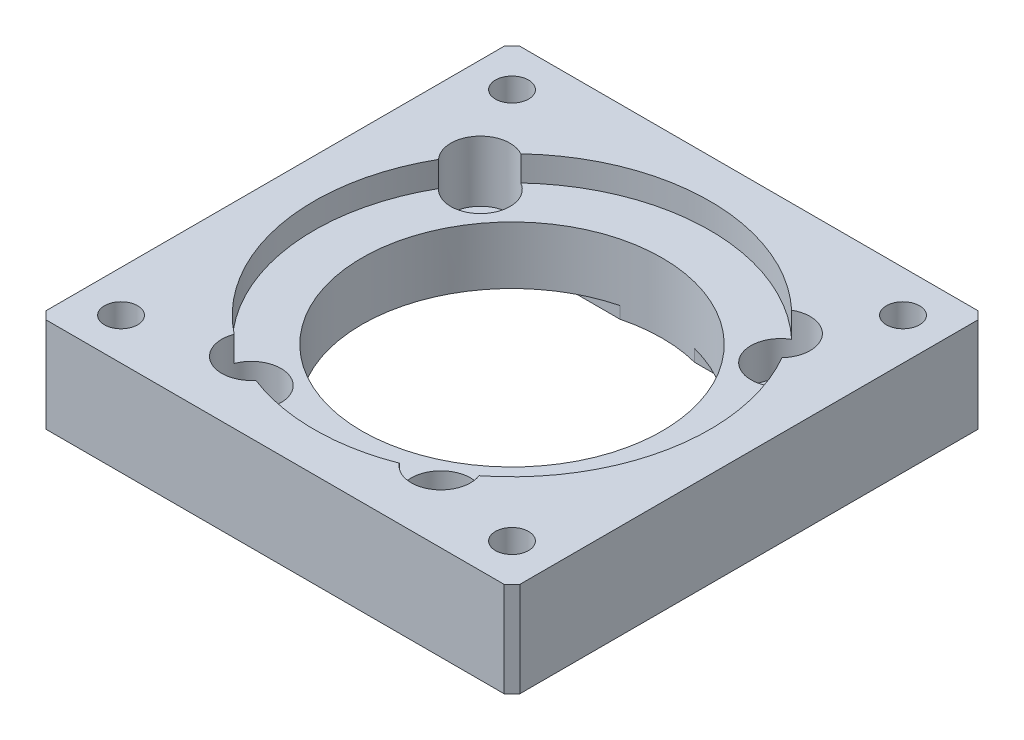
ISO-10303-21;
HEADER;
FILE_DESCRIPTION(('STEP AP214'),'2;1');
FILE_NAME('part.step','',(''),(''),'','','');
FILE_SCHEMA(('AUTOMOTIVE_DESIGN { 1 0 10303 214 1 1 1 1 }'));
ENDSEC;
DATA;
#1=APPLICATION_CONTEXT('core data for automotive mechanical design processes');
#2=APPLICATION_PROTOCOL_DEFINITION('international standard','automotive_design',2000,#1);
#3=PRODUCT_CONTEXT('',#1,'mechanical');
#4=PRODUCT('Part','Part','',(#3));
#5=PRODUCT_RELATED_PRODUCT_CATEGORY('part','',(#4));
#6=PRODUCT_DEFINITION_FORMATION('','',#4);
#7=PRODUCT_DEFINITION_CONTEXT('part definition',#1,'design');
#8=PRODUCT_DEFINITION('design','',#6,#7);
#9=PRODUCT_DEFINITION_SHAPE('','',#8);
#10=(LENGTH_UNIT() NAMED_UNIT(*) SI_UNIT(.MILLI.,.METRE.));
#11=(NAMED_UNIT(*) PLANE_ANGLE_UNIT() SI_UNIT($,.RADIAN.));
#12=(NAMED_UNIT(*) SI_UNIT($,.STERADIAN.) SOLID_ANGLE_UNIT());
#13=UNCERTAINTY_MEASURE_WITH_UNIT(LENGTH_MEASURE(1.E-05),#10,'distance_accuracy_value','');
#14=(GEOMETRIC_REPRESENTATION_CONTEXT(3) GLOBAL_UNCERTAINTY_ASSIGNED_CONTEXT((#13)) GLOBAL_UNIT_ASSIGNED_CONTEXT((#10,
#11,#12)) REPRESENTATION_CONTEXT('',''));
#15=CARTESIAN_POINT('',(0.,0.,0.));
#16=DIRECTION('',(0.,0.,1.));
#17=DIRECTION('',(1.,0.,0.));
#18=AXIS2_PLACEMENT_3D('',#15,#16,#17);
#19=CARTESIAN_POINT('',(0.,8.8,0.));
#20=DIRECTION('',(0.,1.,0.));
#21=DIRECTION('',(0.,0.,1.));
#22=AXIS2_PLACEMENT_3D('',#19,#20,#21);
#23=CYLINDRICAL_SURFACE('',#22,25.05);
#24=CARTESIAN_POINT('',(0.,8.8,0.));
#25=DIRECTION('',(0.,1.,0.));
#26=DIRECTION('',(0.,0.,1.));
#27=AXIS2_PLACEMENT_3D('',#24,#25,#26);
#28=CIRCLE('',#27,25.05);
#29=CARTESIAN_POINT('',(15.5073400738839,8.8,19.6729485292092));
#30=VERTEX_POINT('',#29);
#31=CARTESIAN_POINT('',(21.7418197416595,8.8,-12.441694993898));
#32=VERTEX_POINT('',#31);
#33=EDGE_CURVE('E223',#30,#32,#28,.T.);
#34=ORIENTED_EDGE('',*,*,#33,.F.);
#35=DIRECTION('',(0.,1.,0.));
#36=VECTOR('',#35,1.);
#37=CARTESIAN_POINT('',(15.5073400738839,8.15,19.6729485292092));
#38=LINE('',#37,#36);
#39=CARTESIAN_POINT('',(15.5073400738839,12.,19.6729485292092));
#40=VERTEX_POINT('',#39);
#41=EDGE_CURVE('E52',#30,#40,#38,.T.);
#42=ORIENTED_EDGE('',*,*,#41,.T.);
#43=CARTESIAN_POINT('',(0.,12.,0.));
#44=DIRECTION('',(0.,1.,0.));
#45=DIRECTION('',(0.,0.,1.));
#46=AXIS2_PLACEMENT_3D('',#43,#44,#45);
#47=CIRCLE('',#46,25.05);
#48=CARTESIAN_POINT('',(21.7418197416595,12.,-12.441694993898));
#49=VERTEX_POINT('',#48);
#50=EDGE_CURVE('E221',#40,#49,#47,.T.);
#51=ORIENTED_EDGE('',*,*,#50,.T.);
#52=DIRECTION('',(0.,1.,0.));
#53=VECTOR('',#52,1.);
#54=CARTESIAN_POINT('',(21.7418197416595,8.15,-12.441694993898));
#55=LINE('',#54,#53);
#56=EDGE_CURVE('E451',#49,#32,#55,.F.);
#57=ORIENTED_EDGE('',*,*,#56,.T.);
#58=EDGE_LOOP('',(#34,#42,#51,#57));
#59=FACE_BOUND('',#58,.T.);
#60=ADVANCED_FACE('F38',(#59),#23,.F.);
#61=CARTESIAN_POINT('',(-9.0760445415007,12.,23.3479745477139));
#62=VERTEX_POINT('',#61);
#63=CARTESIAN_POINT('',(9.07604454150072,12.,23.3479745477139));
#64=VERTEX_POINT('',#63);
#65=EDGE_CURVE('E230',#62,#64,#47,.T.);
#66=ORIENTED_EDGE('',*,*,#65,.T.);
#67=DIRECTION('',(0.,1.,0.));
#68=VECTOR('',#67,1.);
#69=CARTESIAN_POINT('',(9.07604454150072,8.15,23.3479745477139));
#70=LINE('',#69,#68);
#71=CARTESIAN_POINT('',(9.07604454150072,8.8,23.3479745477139));
#72=VERTEX_POINT('',#71);
#73=EDGE_CURVE('E211',#64,#72,#70,.F.);
#74=ORIENTED_EDGE('',*,*,#73,.T.);
#75=CARTESIAN_POINT('',(-9.07604454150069,8.8,23.3479745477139));
#76=VERTEX_POINT('',#75);
#77=EDGE_CURVE('E244',#76,#72,#28,.T.);
#78=ORIENTED_EDGE('',*,*,#77,.F.);
#79=DIRECTION('',(0.,1.,0.));
#80=VECTOR('',#79,1.);
#81=CARTESIAN_POINT('',(-9.0760445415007,8.15,23.3479745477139));
#82=LINE('',#81,#80);
#83=EDGE_CURVE('E60',#76,#62,#82,.T.);
#84=ORIENTED_EDGE('',*,*,#83,.T.);
#85=EDGE_LOOP('',(#66,#74,#78,#84));
#86=FACE_BOUND('',#85,.T.);
#87=ADVANCED_FACE('F329',(#86),#23,.F.);
#88=CARTESIAN_POINT('',(0.,12.,0.));
#89=DIRECTION('',(0.,-1.,0.));
#90=DIRECTION('',(0.,0.,-1.));
#91=AXIS2_PLACEMENT_3D('',#88,#89,#90);
#92=PLANE('',#91);
#93=DIRECTION('',(0.,0.,-1.));
#94=VECTOR('',#93,1.);
#95=CARTESIAN_POINT('',(30.,12.,30.));
#96=LINE('',#95,#94);
#97=CARTESIAN_POINT('',(30.,12.,29.));
#98=VERTEX_POINT('',#97);
#99=CARTESIAN_POINT('',(30.,12.,-29.));
#100=VERTEX_POINT('',#99);
#101=EDGE_CURVE('E576',#98,#100,#96,.T.);
#102=ORIENTED_EDGE('',*,*,#101,.T.);
#103=DIRECTION('',(0.707106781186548,0.,0.707106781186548));
#104=VECTOR('',#103,1.);
#105=CARTESIAN_POINT('',(29.,12.,-30.));
#106=LINE('',#105,#104);
#107=CARTESIAN_POINT('',(29.,12.,-30.));
#108=VERTEX_POINT('',#107);
#109=EDGE_CURVE('E437',#100,#108,#106,.F.);
#110=ORIENTED_EDGE('',*,*,#109,.T.);
#111=DIRECTION('',(-1.,0.,0.));
#112=VECTOR('',#111,1.);
#113=CARTESIAN_POINT('',(-30.,12.,-30.));
#114=LINE('',#113,#112);
#115=CARTESIAN_POINT('',(-29.,12.,-30.));
#116=VERTEX_POINT('',#115);
#117=EDGE_CURVE('E607',#108,#116,#114,.T.);
#118=ORIENTED_EDGE('',*,*,#117,.T.);
#119=DIRECTION('',(0.707106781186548,0.,-0.707106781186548));
#120=VECTOR('',#119,1.);
#121=CARTESIAN_POINT('',(-30.,12.,-29.));
#122=LINE('',#121,#120);
#123=CARTESIAN_POINT('',(-30.,12.,-29.));
#124=VERTEX_POINT('',#123);
#125=EDGE_CURVE('E434',#116,#124,#122,.F.);
#126=ORIENTED_EDGE('',*,*,#125,.T.);
#127=DIRECTION('',(0.,0.,1.));
#128=VECTOR('',#127,1.);
#129=CARTESIAN_POINT('',(-30.,12.,30.));
#130=LINE('',#129,#128);
#131=CARTESIAN_POINT('',(-30.,12.,29.));
#132=VERTEX_POINT('',#131);
#133=EDGE_CURVE('E611',#124,#132,#130,.T.);
#134=ORIENTED_EDGE('',*,*,#133,.T.);
#135=DIRECTION('',(-0.707106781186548,0.,-0.707106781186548));
#136=VECTOR('',#135,1.);
#137=CARTESIAN_POINT('',(-29.,12.,30.));
#138=LINE('',#137,#136);
#139=CARTESIAN_POINT('',(-29.,12.,30.));
#140=VERTEX_POINT('',#139);
#141=EDGE_CURVE('E427',#132,#140,#138,.F.);
#142=ORIENTED_EDGE('',*,*,#141,.T.);
#143=DIRECTION('',(1.,0.,0.));
#144=VECTOR('',#143,1.);
#145=CARTESIAN_POINT('',(-30.,12.,30.));
#146=LINE('',#145,#144);
#147=CARTESIAN_POINT('',(29.,12.,30.));
#148=VERTEX_POINT('',#147);
#149=EDGE_CURVE('E582',#140,#148,#146,.T.);
#150=ORIENTED_EDGE('',*,*,#149,.T.);
#151=DIRECTION('',(-0.707106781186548,0.,0.707106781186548));
#152=VECTOR('',#151,1.);
#153=CARTESIAN_POINT('',(30.,12.,29.));
#154=LINE('',#153,#152);
#155=EDGE_CURVE('E435',#148,#98,#154,.F.);
#156=ORIENTED_EDGE('',*,*,#155,.T.);
#157=EDGE_LOOP('',(#102,#110,#118,#126,#134,#142,#150,#156));
#158=FACE_BOUND('',#157,.T.);
#159=CARTESIAN_POINT('',(24.75,12.,24.75));
#160=DIRECTION('',(0.,1.,0.));
#161=DIRECTION('',(0.,0.,1.));
#162=AXIS2_PLACEMENT_3D('',#159,#160,#161);
#163=CIRCLE('',#162,2.1);
#164=CARTESIAN_POINT('',(24.75,12.,26.85));
#165=VERTEX_POINT('',#164);
#166=EDGE_CURVE('E236',#165,#165,#163,.T.);
#167=ORIENTED_EDGE('',*,*,#166,.F.);
#168=EDGE_LOOP('',(#167));
#169=FACE_BOUND('',#168,.T.);
#170=CARTESIAN_POINT('',(-24.75,12.,24.75));
#171=DIRECTION('',(0.,1.,0.));
#172=DIRECTION('',(0.,0.,1.));
#173=AXIS2_PLACEMENT_3D('',#170,#171,#172);
#174=CIRCLE('',#173,2.1);
#175=CARTESIAN_POINT('',(-24.75,12.,26.85));
#176=VERTEX_POINT('',#175);
#177=EDGE_CURVE('E309',#176,#176,#174,.T.);
#178=ORIENTED_EDGE('',*,*,#177,.F.);
#179=EDGE_LOOP('',(#178));
#180=FACE_BOUND('',#179,.T.);
#181=CARTESIAN_POINT('',(-24.75,12.,-24.75));
#182=DIRECTION('',(0.,1.,0.));
#183=DIRECTION('',(0.,0.,1.));
#184=AXIS2_PLACEMENT_3D('',#181,#182,#183);
#185=CIRCLE('',#184,2.1);
#186=CARTESIAN_POINT('',(-24.75,12.,-22.65));
#187=VERTEX_POINT('',#186);
#188=EDGE_CURVE('E305',#187,#187,#185,.T.);
#189=ORIENTED_EDGE('',*,*,#188,.F.);
#190=EDGE_LOOP('',(#189));
#191=FACE_BOUND('',#190,.T.);
#192=CARTESIAN_POINT('',(24.75,12.,-24.75));
#193=DIRECTION('',(0.,1.,0.));
#194=DIRECTION('',(0.,0.,1.));
#195=AXIS2_PLACEMENT_3D('',#192,#193,#194);
#196=CIRCLE('',#195,2.1);
#197=CARTESIAN_POINT('',(24.75,12.,-22.65));
#198=VERTEX_POINT('',#197);
#199=EDGE_CURVE('E301',#198,#198,#196,.T.);
#200=ORIENTED_EDGE('',*,*,#199,.F.);
#201=EDGE_LOOP('',(#200));
#202=FACE_BOUND('',#201,.T.);
#203=ORIENTED_EDGE('',*,*,#50,.F.);
#204=CARTESIAN_POINT('',(12.,12.,21.));
#205=DIRECTION('',(0.,1.,0.));
#206=DIRECTION('',(0.,0.,1.));
#207=AXIS2_PLACEMENT_3D('',#204,#205,#206);
#208=CIRCLE('',#207,3.75);
#209=EDGE_CURVE('E208',#64,#40,#208,.T.);
#210=ORIENTED_EDGE('',*,*,#209,.F.);
#211=ORIENTED_EDGE('',*,*,#65,.F.);
#212=CARTESIAN_POINT('',(-12.,12.,21.));
#213=DIRECTION('',(0.,1.,0.));
#214=DIRECTION('',(0.,0.,1.));
#215=AXIS2_PLACEMENT_3D('',#212,#213,#214);
#216=CIRCLE('',#215,3.75);
#217=CARTESIAN_POINT('',(-15.5073400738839,12.,19.6729485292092));
#218=VERTEX_POINT('',#217);
#219=EDGE_CURVE('E224',#218,#62,#216,.T.);
#220=ORIENTED_EDGE('',*,*,#219,.F.);
#221=CARTESIAN_POINT('',(-21.7418197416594,12.,-12.441694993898));
#222=VERTEX_POINT('',#221);
#223=EDGE_CURVE('E234',#222,#218,#47,.T.);
#224=ORIENTED_EDGE('',*,*,#223,.F.);
#225=CARTESIAN_POINT('',(-19.,12.,-15.));
#226=DIRECTION('',(0.,1.,0.));
#227=DIRECTION('',(0.,0.,1.));
#228=AXIS2_PLACEMENT_3D('',#225,#226,#227);
#229=CIRCLE('',#228,3.75);
#230=CARTESIAN_POINT('',(-17.147873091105,12.,-18.2606940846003));
#231=VERTEX_POINT('',#230);
#232=EDGE_CURVE('E258',#231,#222,#229,.T.);
#233=ORIENTED_EDGE('',*,*,#232,.F.);
#234=CARTESIAN_POINT('',(17.1478730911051,12.,-18.2606940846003));
#235=VERTEX_POINT('',#234);
#236=EDGE_CURVE('E233',#235,#231,#47,.T.);
#237=ORIENTED_EDGE('',*,*,#236,.F.);
#238=CARTESIAN_POINT('',(19.,12.,-15.));
#239=DIRECTION('',(0.,1.,0.));
#240=DIRECTION('',(0.,0.,1.));
#241=AXIS2_PLACEMENT_3D('',#238,#239,#240);
#242=CIRCLE('',#241,3.75);
#243=EDGE_CURVE('E229',#49,#235,#242,.T.);
#244=ORIENTED_EDGE('',*,*,#243,.F.);
#245=EDGE_LOOP('',(#203,#210,#211,#220,#224,#233,#237,#244));
#246=FACE_BOUND('',#245,.T.);
#247=ADVANCED_FACE('F227',(#158,#169,#180,#191,#202,#246),#92,.F.);
#248=ORIENTED_EDGE('',*,*,#223,.T.);
#249=DIRECTION('',(0.,1.,0.));
#250=VECTOR('',#249,1.);
#251=CARTESIAN_POINT('',(-15.5073400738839,8.15,19.6729485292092));
#252=LINE('',#251,#250);
#253=CARTESIAN_POINT('',(-15.5073400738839,8.8,19.6729485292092));
#254=VERTEX_POINT('',#253);
#255=EDGE_CURVE('E253',#218,#254,#252,.F.);
#256=ORIENTED_EDGE('',*,*,#255,.T.);
#257=CARTESIAN_POINT('',(-21.7418197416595,8.8,-12.441694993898));
#258=VERTEX_POINT('',#257);
#259=EDGE_CURVE('E316',#258,#254,#28,.T.);
#260=ORIENTED_EDGE('',*,*,#259,.F.);
#261=DIRECTION('',(0.,1.,0.));
#262=VECTOR('',#261,1.);
#263=CARTESIAN_POINT('',(-21.7418197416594,8.15,-12.441694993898));
#264=LINE('',#263,#262);
#265=EDGE_CURVE('E255',#258,#222,#264,.T.);
#266=ORIENTED_EDGE('',*,*,#265,.T.);
#267=EDGE_LOOP('',(#248,#256,#260,#266));
#268=FACE_BOUND('',#267,.T.);
#269=ADVANCED_FACE('F251',(#268),#23,.F.);
#270=CARTESIAN_POINT('',(0.,-8.,0.));
#271=DIRECTION('',(0.,1.,0.));
#272=DIRECTION('',(0.,0.,1.));
#273=AXIS2_PLACEMENT_3D('',#270,#271,#272);
#274=CYLINDRICAL_SURFACE('',#273,19.);
#275=CARTESIAN_POINT('',(0.,1.5,0.));
#276=DIRECTION('',(0.,-1.,0.));
#277=DIRECTION('',(0.,0.,-1.));
#278=AXIS2_PLACEMENT_3D('',#275,#276,#277);
#279=CIRCLE('',#278,19.);
#280=CARTESIAN_POINT('',(-4.73708771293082,1.5,-18.4));
#281=VERTEX_POINT('',#280);
#282=CARTESIAN_POINT('',(4.73708771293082,1.5,-18.4));
#283=VERTEX_POINT('',#282);
#284=EDGE_CURVE('E579',#281,#283,#279,.F.);
#285=ORIENTED_EDGE('',*,*,#284,.F.);
#286=DIRECTION('',(0.,1.,0.));
#287=VECTOR('',#286,1.);
#288=CARTESIAN_POINT('',(-4.73708771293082,-8.,-18.4));
#289=LINE('',#288,#287);
#290=CARTESIAN_POINT('',(-4.73708771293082,0.,-18.4));
#291=VERTEX_POINT('',#290);
#292=EDGE_CURVE('E585',#281,#291,#289,.F.);
#293=ORIENTED_EDGE('',*,*,#292,.T.);
#294=CARTESIAN_POINT('',(0.,0.,0.));
#295=DIRECTION('',(0.,-1.,0.));
#296=DIRECTION('',(0.,0.,-1.));
#297=AXIS2_PLACEMENT_3D('',#294,#295,#296);
#298=CIRCLE('',#297,19.);
#299=CARTESIAN_POINT('',(4.73708771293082,0.,-18.4));
#300=VERTEX_POINT('',#299);
#301=EDGE_CURVE('E570',#291,#300,#298,.T.);
#302=ORIENTED_EDGE('',*,*,#301,.T.);
#303=DIRECTION('',(0.,1.,0.));
#304=VECTOR('',#303,1.);
#305=CARTESIAN_POINT('',(4.73708771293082,-8.,-18.4));
#306=LINE('',#305,#304);
#307=EDGE_CURVE('E581',#300,#283,#306,.T.);
#308=ORIENTED_EDGE('',*,*,#307,.T.);
#309=EDGE_LOOP('',(#285,#293,#302,#308));
#310=FACE_BOUND('',#309,.T.);
#311=CARTESIAN_POINT('',(0.,8.8,0.));
#312=DIRECTION('',(0.,1.,0.));
#313=DIRECTION('',(0.,0.,1.));
#314=AXIS2_PLACEMENT_3D('',#311,#312,#313);
#315=CIRCLE('',#314,19.);
#316=CARTESIAN_POINT('',(0.,8.8,19.));
#317=VERTEX_POINT('',#316);
#318=EDGE_CURVE('E315',#317,#317,#315,.F.);
#319=ORIENTED_EDGE('',*,*,#318,.F.);
#320=EDGE_LOOP('',(#319));
#321=FACE_BOUND('',#320,.T.);
#322=ADVANCED_FACE('F378',(#310,#321),#274,.F.);
#323=CARTESIAN_POINT('',(30.,12.,30.));
#324=DIRECTION('',(-1.,0.,0.));
#325=DIRECTION('',(0.,0.,1.));
#326=AXIS2_PLACEMENT_3D('',#323,#324,#325);
#327=PLANE('',#326);
#328=DIRECTION('',(0.,0.,-1.));
#329=VECTOR('',#328,1.);
#330=CARTESIAN_POINT('',(30.,0.,30.));
#331=LINE('',#330,#329);
#332=CARTESIAN_POINT('',(30.,0.,29.));
#333=VERTEX_POINT('',#332);
#334=CARTESIAN_POINT('',(30.,0.,-29.));
#335=VERTEX_POINT('',#334);
#336=EDGE_CURVE('E565',#333,#335,#331,.T.);
#337=ORIENTED_EDGE('',*,*,#336,.T.);
#338=DIRECTION('',(0.,1.,0.));
#339=VECTOR('',#338,1.);
#340=CARTESIAN_POINT('',(30.,12.,-29.));
#341=LINE('',#340,#339);
#342=EDGE_CURVE('E439',#335,#100,#341,.T.);
#343=ORIENTED_EDGE('',*,*,#342,.T.);
#344=ORIENTED_EDGE('',*,*,#101,.F.);
#345=DIRECTION('',(0.,-1.,0.));
#346=VECTOR('',#345,1.);
#347=CARTESIAN_POINT('',(30.,12.,29.));
#348=LINE('',#347,#346);
#349=EDGE_CURVE('E598',#98,#333,#348,.T.);
#350=ORIENTED_EDGE('',*,*,#349,.T.);
#351=EDGE_LOOP('',(#337,#343,#344,#350));
#352=FACE_BOUND('',#351,.T.);
#353=ADVANCED_FACE('F383',(#352),#327,.F.);
#354=CARTESIAN_POINT('',(-30.,12.,-30.));
#355=DIRECTION('',(0.,0.,1.));
#356=DIRECTION('',(1.,0.,0.));
#357=AXIS2_PLACEMENT_3D('',#354,#355,#356);
#358=PLANE('',#357);
#359=ORIENTED_EDGE('',*,*,#117,.F.);
#360=DIRECTION('',(0.,-1.,0.));
#361=VECTOR('',#360,1.);
#362=CARTESIAN_POINT('',(29.,12.,-30.));
#363=LINE('',#362,#361);
#364=CARTESIAN_POINT('',(29.,0.,-30.));
#365=VERTEX_POINT('',#364);
#366=EDGE_CURVE('E590',#108,#365,#363,.T.);
#367=ORIENTED_EDGE('',*,*,#366,.T.);
#368=DIRECTION('',(-1.,0.,0.));
#369=VECTOR('',#368,1.);
#370=CARTESIAN_POINT('',(-30.,0.,-30.));
#371=LINE('',#370,#369);
#372=CARTESIAN_POINT('',(-29.,0.,-30.));
#373=VERTEX_POINT('',#372);
#374=EDGE_CURVE('E556',#365,#373,#371,.T.);
#375=ORIENTED_EDGE('',*,*,#374,.T.);
#376=DIRECTION('',(0.,1.,0.));
#377=VECTOR('',#376,1.);
#378=CARTESIAN_POINT('',(-29.,12.,-30.));
#379=LINE('',#378,#377);
#380=EDGE_CURVE('E587',#373,#116,#379,.T.);
#381=ORIENTED_EDGE('',*,*,#380,.T.);
#382=EDGE_LOOP('',(#359,#367,#375,#381));
#383=FACE_BOUND('',#382,.T.);
#384=ADVANCED_FACE('F406',(#383),#358,.F.);
#385=CARTESIAN_POINT('',(-30.,12.,30.));
#386=DIRECTION('',(1.,0.,0.));
#387=DIRECTION('',(0.,0.,-1.));
#388=AXIS2_PLACEMENT_3D('',#385,#386,#387);
#389=PLANE('',#388);
#390=ORIENTED_EDGE('',*,*,#133,.F.);
#391=DIRECTION('',(0.,-1.,0.));
#392=VECTOR('',#391,1.);
#393=CARTESIAN_POINT('',(-30.,12.,-29.));
#394=LINE('',#393,#392);
#395=CARTESIAN_POINT('',(-30.,0.,-29.));
#396=VERTEX_POINT('',#395);
#397=EDGE_CURVE('E445',#124,#396,#394,.T.);
#398=ORIENTED_EDGE('',*,*,#397,.T.);
#399=DIRECTION('',(0.,0.,1.));
#400=VECTOR('',#399,1.);
#401=CARTESIAN_POINT('',(-30.,0.,30.));
#402=LINE('',#401,#400);
#403=CARTESIAN_POINT('',(-30.,0.,29.));
#404=VERTEX_POINT('',#403);
#405=EDGE_CURVE('E564',#396,#404,#402,.T.);
#406=ORIENTED_EDGE('',*,*,#405,.T.);
#407=DIRECTION('',(0.,1.,0.));
#408=VECTOR('',#407,1.);
#409=CARTESIAN_POINT('',(-30.,12.,29.));
#410=LINE('',#409,#408);
#411=EDGE_CURVE('E428',#404,#132,#410,.T.);
#412=ORIENTED_EDGE('',*,*,#411,.T.);
#413=EDGE_LOOP('',(#390,#398,#406,#412));
#414=FACE_BOUND('',#413,.T.);
#415=ADVANCED_FACE('F402',(#414),#389,.F.);
#416=CARTESIAN_POINT('',(-30.,12.,30.));
#417=DIRECTION('',(0.,0.,-1.));
#418=DIRECTION('',(-1.,0.,0.));
#419=AXIS2_PLACEMENT_3D('',#416,#417,#418);
#420=PLANE('',#419);
#421=ORIENTED_EDGE('',*,*,#149,.F.);
#422=DIRECTION('',(0.,-1.,0.));
#423=VECTOR('',#422,1.);
#424=CARTESIAN_POINT('',(-29.,12.,30.));
#425=LINE('',#424,#423);
#426=CARTESIAN_POINT('',(-29.,0.,30.));
#427=VERTEX_POINT('',#426);
#428=EDGE_CURVE('E430',#140,#427,#425,.T.);
#429=ORIENTED_EDGE('',*,*,#428,.T.);
#430=DIRECTION('',(1.,0.,0.));
#431=VECTOR('',#430,1.);
#432=CARTESIAN_POINT('',(-30.,0.,30.));
#433=LINE('',#432,#431);
#434=CARTESIAN_POINT('',(29.,0.,30.));
#435=VERTEX_POINT('',#434);
#436=EDGE_CURVE('E568',#427,#435,#433,.T.);
#437=ORIENTED_EDGE('',*,*,#436,.T.);
#438=DIRECTION('',(0.,1.,0.));
#439=VECTOR('',#438,1.);
#440=CARTESIAN_POINT('',(29.,12.,30.));
#441=LINE('',#440,#439);
#442=EDGE_CURVE('E448',#435,#148,#441,.T.);
#443=ORIENTED_EDGE('',*,*,#442,.T.);
#444=EDGE_LOOP('',(#421,#429,#437,#443));
#445=FACE_BOUND('',#444,.T.);
#446=ADVANCED_FACE('F398',(#445),#420,.F.);
#447=CARTESIAN_POINT('',(0.,0.,0.));
#448=DIRECTION('',(0.,-1.,0.));
#449=DIRECTION('',(0.,0.,-1.));
#450=AXIS2_PLACEMENT_3D('',#447,#448,#449);
#451=PLANE('',#450);
#452=CARTESIAN_POINT('',(24.75,0.,-24.75));
#453=DIRECTION('',(0.,-1.,0.));
#454=DIRECTION('',(0.,0.,-1.));
#455=AXIS2_PLACEMENT_3D('',#452,#453,#454);
#456=CIRCLE('',#455,2.1);
#457=CARTESIAN_POINT('',(24.75,0.,-26.85));
#458=VERTEX_POINT('',#457);
#459=EDGE_CURVE('E304',#458,#458,#456,.T.);
#460=ORIENTED_EDGE('',*,*,#459,.F.);
#461=EDGE_LOOP('',(#460));
#462=FACE_BOUND('',#461,.T.);
#463=CARTESIAN_POINT('',(-24.75,0.,-24.75));
#464=DIRECTION('',(0.,-1.,0.));
#465=DIRECTION('',(0.,0.,-1.));
#466=AXIS2_PLACEMENT_3D('',#463,#464,#465);
#467=CIRCLE('',#466,2.1);
#468=CARTESIAN_POINT('',(-24.75,0.,-26.85));
#469=VERTEX_POINT('',#468);
#470=EDGE_CURVE('E308',#469,#469,#467,.T.);
#471=ORIENTED_EDGE('',*,*,#470,.F.);
#472=EDGE_LOOP('',(#471));
#473=FACE_BOUND('',#472,.T.);
#474=CARTESIAN_POINT('',(-24.75,0.,24.75));
#475=DIRECTION('',(0.,-1.,0.));
#476=DIRECTION('',(0.,0.,-1.));
#477=AXIS2_PLACEMENT_3D('',#474,#475,#476);
#478=CIRCLE('',#477,2.1);
#479=CARTESIAN_POINT('',(-24.75,0.,22.65));
#480=VERTEX_POINT('',#479);
#481=EDGE_CURVE('E312',#480,#480,#478,.T.);
#482=ORIENTED_EDGE('',*,*,#481,.F.);
#483=EDGE_LOOP('',(#482));
#484=FACE_BOUND('',#483,.T.);
#485=CARTESIAN_POINT('',(24.75,0.,24.75));
#486=DIRECTION('',(0.,-1.,0.));
#487=DIRECTION('',(0.,0.,-1.));
#488=AXIS2_PLACEMENT_3D('',#485,#486,#487);
#489=CIRCLE('',#488,2.1);
#490=CARTESIAN_POINT('',(24.75,0.,22.65));
#491=VERTEX_POINT('',#490);
#492=EDGE_CURVE('E231',#491,#491,#489,.T.);
#493=ORIENTED_EDGE('',*,*,#492,.F.);
#494=EDGE_LOOP('',(#493));
#495=FACE_BOUND('',#494,.T.);
#496=DIRECTION('',(1.,0.,0.));
#497=VECTOR('',#496,1.);
#498=CARTESIAN_POINT('',(-16.,0.,-18.4));
#499=LINE('',#498,#497);
#500=CARTESIAN_POINT('',(16.,0.,-18.4));
#501=VERTEX_POINT('',#500);
#502=EDGE_CURVE('E552',#300,#501,#499,.T.);
#503=ORIENTED_EDGE('',*,*,#502,.F.);
#504=ORIENTED_EDGE('',*,*,#301,.F.);
#505=CARTESIAN_POINT('',(-16.,0.,-18.4));
#506=VERTEX_POINT('',#505);
#507=EDGE_CURVE('E636',#506,#291,#499,.T.);
#508=ORIENTED_EDGE('',*,*,#507,.F.);
#509=CARTESIAN_POINT('',(-20.,0.,-18.4));
#510=DIRECTION('',(0.,-1.,0.));
#511=DIRECTION('',(0.,0.,-1.));
#512=AXIS2_PLACEMENT_3D('',#509,#510,#511);
#513=CIRCLE('',#512,4.);
#514=CARTESIAN_POINT('',(-24.,0.,-18.4));
#515=VERTEX_POINT('',#514);
#516=EDGE_CURVE('E639',#515,#506,#513,.T.);
#517=ORIENTED_EDGE('',*,*,#516,.F.);
#518=DIRECTION('',(0.,0.,-1.));
#519=VECTOR('',#518,1.);
#520=CARTESIAN_POINT('',(-24.,0.,19.));
#521=LINE('',#520,#519);
#522=CARTESIAN_POINT('',(-24.,0.,19.));
#523=VERTEX_POINT('',#522);
#524=EDGE_CURVE('E642',#523,#515,#521,.T.);
#525=ORIENTED_EDGE('',*,*,#524,.F.);
#526=CARTESIAN_POINT('',(-19.,0.,19.));
#527=DIRECTION('',(0.,-1.,0.));
#528=DIRECTION('',(0.,0.,1.));
#529=AXIS2_PLACEMENT_3D('',#526,#527,#528);
#530=CIRCLE('',#529,5.);
#531=CARTESIAN_POINT('',(-19.,0.,24.));
#532=VERTEX_POINT('',#531);
#533=EDGE_CURVE('E645',#532,#523,#530,.T.);
#534=ORIENTED_EDGE('',*,*,#533,.F.);
#535=DIRECTION('',(-1.,0.,0.));
#536=VECTOR('',#535,1.);
#537=CARTESIAN_POINT('',(-19.,0.,24.));
#538=LINE('',#537,#536);
#539=CARTESIAN_POINT('',(19.,0.,24.));
#540=VERTEX_POINT('',#539);
#541=EDGE_CURVE('E648',#540,#532,#538,.T.);
#542=ORIENTED_EDGE('',*,*,#541,.F.);
#543=CARTESIAN_POINT('',(19.,0.,19.));
#544=DIRECTION('',(0.,-1.,0.));
#545=DIRECTION('',(0.,0.,-1.));
#546=AXIS2_PLACEMENT_3D('',#543,#544,#545);
#547=CIRCLE('',#546,5.);
#548=CARTESIAN_POINT('',(24.,0.,19.));
#549=VERTEX_POINT('',#548);
#550=EDGE_CURVE('E651',#549,#540,#547,.T.);
#551=ORIENTED_EDGE('',*,*,#550,.F.);
#552=DIRECTION('',(0.,0.,1.));
#553=VECTOR('',#552,1.);
#554=CARTESIAN_POINT('',(24.,0.,19.));
#555=LINE('',#554,#553);
#556=CARTESIAN_POINT('',(24.,0.,-18.4));
#557=VERTEX_POINT('',#556);
#558=EDGE_CURVE('E654',#557,#549,#555,.T.);
#559=ORIENTED_EDGE('',*,*,#558,.F.);
#560=CARTESIAN_POINT('',(20.,0.,-18.4));
#561=DIRECTION('',(0.,-1.,0.));
#562=DIRECTION('',(0.,0.,-1.));
#563=AXIS2_PLACEMENT_3D('',#560,#561,#562);
#564=CIRCLE('',#563,4.);
#565=EDGE_CURVE('E322',#501,#557,#564,.T.);
#566=ORIENTED_EDGE('',*,*,#565,.F.);
#567=EDGE_LOOP('',(#503,#504,#508,#517,#525,#534,#542,#551,#559,#566));
#568=FACE_BOUND('',#567,.T.);
#569=ORIENTED_EDGE('',*,*,#374,.F.);
#570=DIRECTION('',(-0.707106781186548,0.,-0.707106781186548));
#571=VECTOR('',#570,1.);
#572=CARTESIAN_POINT('',(29.5,0.,-29.5));
#573=LINE('',#572,#571);
#574=EDGE_CURVE('E558',#365,#335,#573,.F.);
#575=ORIENTED_EDGE('',*,*,#574,.T.);
#576=ORIENTED_EDGE('',*,*,#336,.F.);
#577=DIRECTION('',(0.707106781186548,0.,-0.707106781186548));
#578=VECTOR('',#577,1.);
#579=CARTESIAN_POINT('',(29.5,0.,29.5));
#580=LINE('',#579,#578);
#581=EDGE_CURVE('E592',#333,#435,#580,.F.);
#582=ORIENTED_EDGE('',*,*,#581,.T.);
#583=ORIENTED_EDGE('',*,*,#436,.F.);
#584=DIRECTION('',(0.707106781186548,0.,0.707106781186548));
#585=VECTOR('',#584,1.);
#586=CARTESIAN_POINT('',(-29.5,0.,29.5));
#587=LINE('',#586,#585);
#588=EDGE_CURVE('E594',#427,#404,#587,.F.);
#589=ORIENTED_EDGE('',*,*,#588,.T.);
#590=ORIENTED_EDGE('',*,*,#405,.F.);
#591=DIRECTION('',(-0.707106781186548,0.,0.707106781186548));
#592=VECTOR('',#591,1.);
#593=CARTESIAN_POINT('',(-29.5,0.,-29.5));
#594=LINE('',#593,#592);
#595=EDGE_CURVE('E561',#396,#373,#594,.F.);
#596=ORIENTED_EDGE('',*,*,#595,.T.);
#597=EDGE_LOOP('',(#569,#575,#576,#582,#583,#589,#590,#596));
#598=FACE_BOUND('',#597,.T.);
#599=ADVANCED_FACE('F394',(#462,#473,#484,#495,#568,#598),#451,.T.);
#600=CARTESIAN_POINT('',(-16.,1.5,-18.4));
#601=DIRECTION('',(0.,0.,-1.));
#602=DIRECTION('',(-1.,0.,0.));
#603=AXIS2_PLACEMENT_3D('',#600,#601,#602);
#604=PLANE('',#603);
#605=DIRECTION('',(1.,0.,0.));
#606=VECTOR('',#605,1.);
#607=CARTESIAN_POINT('',(-16.,1.5,-18.4));
#608=LINE('',#607,#606);
#609=CARTESIAN_POINT('',(-16.,1.5,-18.4));
#610=VERTEX_POINT('',#609);
#611=EDGE_CURVE('E622',#610,#281,#608,.T.);
#612=ORIENTED_EDGE('',*,*,#611,.F.);
#613=DIRECTION('',(0.,-1.,0.));
#614=VECTOR('',#613,1.);
#615=CARTESIAN_POINT('',(-16.,1.5,-18.4));
#616=LINE('',#615,#614);
#617=EDGE_CURVE('E632',#610,#506,#616,.T.);
#618=ORIENTED_EDGE('',*,*,#617,.T.);
#619=ORIENTED_EDGE('',*,*,#507,.T.);
#620=ORIENTED_EDGE('',*,*,#292,.F.);
#621=EDGE_LOOP('',(#612,#618,#619,#620));
#622=FACE_BOUND('',#621,.T.);
#623=ADVANCED_FACE('F397',(#622),#604,.F.);
#624=ORIENTED_EDGE('',*,*,#502,.T.);
#625=DIRECTION('',(0.,-1.,0.));
#626=VECTOR('',#625,1.);
#627=CARTESIAN_POINT('',(16.,1.5,-18.4));
#628=LINE('',#627,#626);
#629=CARTESIAN_POINT('',(16.,1.5,-18.4));
#630=VERTEX_POINT('',#629);
#631=EDGE_CURVE('E578',#630,#501,#628,.T.);
#632=ORIENTED_EDGE('',*,*,#631,.F.);
#633=EDGE_CURVE('E660',#283,#630,#608,.T.);
#634=ORIENTED_EDGE('',*,*,#633,.F.);
#635=ORIENTED_EDGE('',*,*,#307,.F.);
#636=EDGE_LOOP('',(#624,#632,#634,#635));
#637=FACE_BOUND('',#636,.T.);
#638=ADVANCED_FACE('F714',(#637),#604,.F.);
#639=CARTESIAN_POINT('',(20.,1.5,-18.4));
#640=DIRECTION('',(0.,-1.,0.));
#641=DIRECTION('',(0.,0.,-1.));
#642=AXIS2_PLACEMENT_3D('',#639,#640,#641);
#643=PLANE('',#642);
#644=CARTESIAN_POINT('',(12.,1.5,21.));
#645=DIRECTION('',(0.,-1.,0.));
#646=DIRECTION('',(0.,0.,-1.));
#647=AXIS2_PLACEMENT_3D('',#644,#645,#646);
#648=CIRCLE('',#647,1.41786025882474);
#649=CARTESIAN_POINT('',(12.,1.5,19.5821397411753));
#650=VERTEX_POINT('',#649);
#651=EDGE_CURVE('E330',#650,#650,#648,.T.);
#652=ORIENTED_EDGE('',*,*,#651,.F.);
#653=EDGE_LOOP('',(#652));
#654=FACE_BOUND('',#653,.T.);
#655=CARTESIAN_POINT('',(-12.,1.5,21.));
#656=DIRECTION('',(0.,-1.,0.));
#657=DIRECTION('',(0.,0.,-1.));
#658=AXIS2_PLACEMENT_3D('',#655,#656,#657);
#659=CIRCLE('',#658,1.41786025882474);
#660=CARTESIAN_POINT('',(-12.,1.5,19.5821397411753));
#661=VERTEX_POINT('',#660);
#662=EDGE_CURVE('E271',#661,#661,#659,.T.);
#663=ORIENTED_EDGE('',*,*,#662,.F.);
#664=EDGE_LOOP('',(#663));
#665=FACE_BOUND('',#664,.T.);
#666=CARTESIAN_POINT('',(-19.,1.5,-15.));
#667=DIRECTION('',(0.,-1.,0.));
#668=DIRECTION('',(0.,0.,-1.));
#669=AXIS2_PLACEMENT_3D('',#666,#667,#668);
#670=CIRCLE('',#669,1.41786025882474);
#671=CARTESIAN_POINT('',(-19.,1.5,-16.4178602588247));
#672=VERTEX_POINT('',#671);
#673=EDGE_CURVE('E286',#672,#672,#670,.T.);
#674=ORIENTED_EDGE('',*,*,#673,.F.);
#675=EDGE_LOOP('',(#674));
#676=FACE_BOUND('',#675,.T.);
#677=CARTESIAN_POINT('',(19.,1.5,-15.));
#678=DIRECTION('',(0.,-1.,0.));
#679=DIRECTION('',(0.,0.,-1.));
#680=AXIS2_PLACEMENT_3D('',#677,#678,#679);
#681=CIRCLE('',#680,1.41786025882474);
#682=CARTESIAN_POINT('',(19.,1.5,-16.4178602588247));
#683=VERTEX_POINT('',#682);
#684=EDGE_CURVE('E297',#683,#683,#681,.T.);
#685=ORIENTED_EDGE('',*,*,#684,.F.);
#686=EDGE_LOOP('',(#685));
#687=FACE_BOUND('',#686,.T.);
#688=ORIENTED_EDGE('',*,*,#284,.T.);
#689=ORIENTED_EDGE('',*,*,#633,.T.);
#690=CARTESIAN_POINT('',(20.,1.5,-18.4));
#691=DIRECTION('',(0.,-1.,0.));
#692=DIRECTION('',(0.,0.,-1.));
#693=AXIS2_PLACEMENT_3D('',#690,#691,#692);
#694=CIRCLE('',#693,4.);
#695=CARTESIAN_POINT('',(24.,1.5,-18.4));
#696=VERTEX_POINT('',#695);
#697=EDGE_CURVE('E638',#630,#696,#694,.T.);
#698=ORIENTED_EDGE('',*,*,#697,.T.);
#699=DIRECTION('',(0.,0.,1.));
#700=VECTOR('',#699,1.);
#701=CARTESIAN_POINT('',(24.,1.5,19.));
#702=LINE('',#701,#700);
#703=CARTESIAN_POINT('',(24.,1.5,19.));
#704=VERTEX_POINT('',#703);
#705=EDGE_CURVE('E676',#696,#704,#702,.T.);
#706=ORIENTED_EDGE('',*,*,#705,.T.);
#707=CARTESIAN_POINT('',(19.,1.5,19.));
#708=DIRECTION('',(0.,-1.,0.));
#709=DIRECTION('',(0.,0.,-1.));
#710=AXIS2_PLACEMENT_3D('',#707,#708,#709);
#711=CIRCLE('',#710,5.);
#712=CARTESIAN_POINT('',(19.,1.5,24.));
#713=VERTEX_POINT('',#712);
#714=EDGE_CURVE('E673',#704,#713,#711,.T.);
#715=ORIENTED_EDGE('',*,*,#714,.T.);
#716=DIRECTION('',(-1.,0.,0.));
#717=VECTOR('',#716,1.);
#718=CARTESIAN_POINT('',(-19.,1.5,24.));
#719=LINE('',#718,#717);
#720=CARTESIAN_POINT('',(-19.,1.5,24.));
#721=VERTEX_POINT('',#720);
#722=EDGE_CURVE('E670',#713,#721,#719,.T.);
#723=ORIENTED_EDGE('',*,*,#722,.T.);
#724=CARTESIAN_POINT('',(-19.,1.5,19.));
#725=DIRECTION('',(0.,-1.,0.));
#726=DIRECTION('',(0.,0.,1.));
#727=AXIS2_PLACEMENT_3D('',#724,#725,#726);
#728=CIRCLE('',#727,5.);
#729=CARTESIAN_POINT('',(-24.,1.5,19.));
#730=VERTEX_POINT('',#729);
#731=EDGE_CURVE('E667',#721,#730,#728,.T.);
#732=ORIENTED_EDGE('',*,*,#731,.T.);
#733=DIRECTION('',(0.,0.,-1.));
#734=VECTOR('',#733,1.);
#735=CARTESIAN_POINT('',(-24.,1.5,19.));
#736=LINE('',#735,#734);
#737=CARTESIAN_POINT('',(-24.,1.5,-18.4));
#738=VERTEX_POINT('',#737);
#739=EDGE_CURVE('E664',#730,#738,#736,.T.);
#740=ORIENTED_EDGE('',*,*,#739,.T.);
#741=CARTESIAN_POINT('',(-20.,1.5,-18.4));
#742=DIRECTION('',(0.,-1.,0.));
#743=DIRECTION('',(0.,0.,-1.));
#744=AXIS2_PLACEMENT_3D('',#741,#742,#743);
#745=CIRCLE('',#744,4.);
#746=EDGE_CURVE('E661',#738,#610,#745,.T.);
#747=ORIENTED_EDGE('',*,*,#746,.T.);
#748=ORIENTED_EDGE('',*,*,#611,.T.);
#749=EDGE_LOOP('',(#688,#689,#698,#706,#715,#723,#732,#740,#747,#748));
#750=FACE_BOUND('',#749,.T.);
#751=ADVANCED_FACE('F681',(#654,#665,#676,#687,#750),#643,.T.);
#752=CARTESIAN_POINT('',(20.,1.5,-18.4));
#753=DIRECTION('',(0.,-1.,0.));
#754=DIRECTION('',(0.,0.,-1.));
#755=AXIS2_PLACEMENT_3D('',#752,#753,#754);
#756=CYLINDRICAL_SURFACE('',#755,4.);
#757=ORIENTED_EDGE('',*,*,#565,.T.);
#758=DIRECTION('',(0.,-1.,0.));
#759=VECTOR('',#758,1.);
#760=CARTESIAN_POINT('',(24.,1.5,-18.4));
#761=LINE('',#760,#759);
#762=EDGE_CURVE('E619',#696,#557,#761,.T.);
#763=ORIENTED_EDGE('',*,*,#762,.F.);
#764=ORIENTED_EDGE('',*,*,#697,.F.);
#765=ORIENTED_EDGE('',*,*,#631,.T.);
#766=EDGE_LOOP('',(#757,#763,#764,#765));
#767=FACE_BOUND('',#766,.T.);
#768=ADVANCED_FACE('F686',(#767),#756,.F.);
#769=CARTESIAN_POINT('',(-20.,1.5,-18.4));
#770=DIRECTION('',(0.,-1.,0.));
#771=DIRECTION('',(0.,0.,-1.));
#772=AXIS2_PLACEMENT_3D('',#769,#770,#771);
#773=CYLINDRICAL_SURFACE('',#772,4.);
#774=ORIENTED_EDGE('',*,*,#516,.T.);
#775=ORIENTED_EDGE('',*,*,#617,.F.);
#776=ORIENTED_EDGE('',*,*,#746,.F.);
#777=DIRECTION('',(0.,-1.,0.));
#778=VECTOR('',#777,1.);
#779=CARTESIAN_POINT('',(-24.,1.5,-18.4));
#780=LINE('',#779,#778);
#781=EDGE_CURVE('E630',#738,#515,#780,.T.);
#782=ORIENTED_EDGE('',*,*,#781,.T.);
#783=EDGE_LOOP('',(#774,#775,#776,#782));
#784=FACE_BOUND('',#783,.T.);
#785=ADVANCED_FACE('F723',(#784),#773,.F.);
#786=CARTESIAN_POINT('',(-24.,1.5,19.));
#787=DIRECTION('',(-1.,0.,0.));
#788=DIRECTION('',(0.,0.,1.));
#789=AXIS2_PLACEMENT_3D('',#786,#787,#788);
#790=PLANE('',#789);
#791=ORIENTED_EDGE('',*,*,#524,.T.);
#792=ORIENTED_EDGE('',*,*,#781,.F.);
#793=ORIENTED_EDGE('',*,*,#739,.F.);
#794=DIRECTION('',(0.,-1.,0.));
#795=VECTOR('',#794,1.);
#796=CARTESIAN_POINT('',(-24.,1.5,19.));
#797=LINE('',#796,#795);
#798=EDGE_CURVE('E628',#730,#523,#797,.T.);
#799=ORIENTED_EDGE('',*,*,#798,.T.);
#800=EDGE_LOOP('',(#791,#792,#793,#799));
#801=FACE_BOUND('',#800,.T.);
#802=ADVANCED_FACE('F704',(#801),#790,.F.);
#803=CARTESIAN_POINT('',(-19.,1.5,19.));
#804=DIRECTION('',(0.,-1.,0.));
#805=DIRECTION('',(0.,0.,-1.));
#806=AXIS2_PLACEMENT_3D('',#803,#804,#805);
#807=CYLINDRICAL_SURFACE('',#806,5.);
#808=ORIENTED_EDGE('',*,*,#533,.T.);
#809=ORIENTED_EDGE('',*,*,#798,.F.);
#810=ORIENTED_EDGE('',*,*,#731,.F.);
#811=DIRECTION('',(0.,-1.,0.));
#812=VECTOR('',#811,1.);
#813=CARTESIAN_POINT('',(-19.,1.5,24.));
#814=LINE('',#813,#812);
#815=EDGE_CURVE('E626',#721,#532,#814,.T.);
#816=ORIENTED_EDGE('',*,*,#815,.T.);
#817=EDGE_LOOP('',(#808,#809,#810,#816));
#818=FACE_BOUND('',#817,.T.);
#819=ADVANCED_FACE('F700',(#818),#807,.F.);
#820=CARTESIAN_POINT('',(-19.,1.5,24.));
#821=DIRECTION('',(0.,0.,1.));
#822=DIRECTION('',(1.,0.,0.));
#823=AXIS2_PLACEMENT_3D('',#820,#821,#822);
#824=PLANE('',#823);
#825=ORIENTED_EDGE('',*,*,#541,.T.);
#826=ORIENTED_EDGE('',*,*,#815,.F.);
#827=ORIENTED_EDGE('',*,*,#722,.F.);
#828=DIRECTION('',(0.,-1.,0.));
#829=VECTOR('',#828,1.);
#830=CARTESIAN_POINT('',(19.,1.5,24.));
#831=LINE('',#830,#829);
#832=EDGE_CURVE('E624',#713,#540,#831,.T.);
#833=ORIENTED_EDGE('',*,*,#832,.T.);
#834=EDGE_LOOP('',(#825,#826,#827,#833));
#835=FACE_BOUND('',#834,.T.);
#836=ADVANCED_FACE('F696',(#835),#824,.F.);
#837=CARTESIAN_POINT('',(19.,1.5,19.));
#838=DIRECTION('',(0.,-1.,0.));
#839=DIRECTION('',(0.,0.,-1.));
#840=AXIS2_PLACEMENT_3D('',#837,#838,#839);
#841=CYLINDRICAL_SURFACE('',#840,5.);
#842=ORIENTED_EDGE('',*,*,#550,.T.);
#843=ORIENTED_EDGE('',*,*,#832,.F.);
#844=ORIENTED_EDGE('',*,*,#714,.F.);
#845=DIRECTION('',(0.,-1.,0.));
#846=VECTOR('',#845,1.);
#847=CARTESIAN_POINT('',(24.,1.5,19.));
#848=LINE('',#847,#846);
#849=EDGE_CURVE('E621',#704,#549,#848,.T.);
#850=ORIENTED_EDGE('',*,*,#849,.T.);
#851=EDGE_LOOP('',(#842,#843,#844,#850));
#852=FACE_BOUND('',#851,.T.);
#853=ADVANCED_FACE('F692',(#852),#841,.F.);
#854=CARTESIAN_POINT('',(24.,1.5,19.));
#855=DIRECTION('',(1.,0.,0.));
#856=DIRECTION('',(0.,0.,-1.));
#857=AXIS2_PLACEMENT_3D('',#854,#855,#856);
#858=PLANE('',#857);
#859=ORIENTED_EDGE('',*,*,#558,.T.);
#860=ORIENTED_EDGE('',*,*,#849,.F.);
#861=ORIENTED_EDGE('',*,*,#705,.F.);
#862=ORIENTED_EDGE('',*,*,#762,.T.);
#863=EDGE_LOOP('',(#859,#860,#861,#862));
#864=FACE_BOUND('',#863,.T.);
#865=ADVANCED_FACE('F376',(#864),#858,.F.);
#866=CARTESIAN_POINT('',(0.,8.8,0.));
#867=DIRECTION('',(0.,1.,0.));
#868=DIRECTION('',(0.,0.,1.));
#869=AXIS2_PLACEMENT_3D('',#866,#867,#868);
#870=PLANE('',#869);
#871=CARTESIAN_POINT('',(12.,8.8,21.));
#872=DIRECTION('',(0.,1.,0.));
#873=DIRECTION('',(0.,0.,1.));
#874=AXIS2_PLACEMENT_3D('',#871,#872,#873);
#875=CIRCLE('',#874,3.75);
#876=EDGE_CURVE('E11',#30,#72,#875,.T.);
#877=ORIENTED_EDGE('',*,*,#876,.F.);
#878=ORIENTED_EDGE('',*,*,#33,.T.);
#879=CARTESIAN_POINT('',(19.,8.8,-15.));
#880=DIRECTION('',(0.,1.,0.));
#881=DIRECTION('',(0.,0.,1.));
#882=AXIS2_PLACEMENT_3D('',#879,#880,#881);
#883=CIRCLE('',#882,3.75);
#884=CARTESIAN_POINT('',(17.147873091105,8.8,-18.2606940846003));
#885=VERTEX_POINT('',#884);
#886=EDGE_CURVE('E298',#885,#32,#883,.T.);
#887=ORIENTED_EDGE('',*,*,#886,.F.);
#888=CARTESIAN_POINT('',(-17.147873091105,8.8,-18.2606940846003));
#889=VERTEX_POINT('',#888);
#890=EDGE_CURVE('E245',#885,#889,#28,.T.);
#891=ORIENTED_EDGE('',*,*,#890,.T.);
#892=CARTESIAN_POINT('',(-19.,8.8,-15.));
#893=DIRECTION('',(0.,1.,0.));
#894=DIRECTION('',(0.,0.,1.));
#895=AXIS2_PLACEMENT_3D('',#892,#893,#894);
#896=CIRCLE('',#895,3.75);
#897=EDGE_CURVE('E284',#258,#889,#896,.T.);
#898=ORIENTED_EDGE('',*,*,#897,.F.);
#899=ORIENTED_EDGE('',*,*,#259,.T.);
#900=CARTESIAN_POINT('',(-12.,8.8,21.));
#901=DIRECTION('',(0.,1.,0.));
#902=DIRECTION('',(0.,0.,1.));
#903=AXIS2_PLACEMENT_3D('',#900,#901,#902);
#904=CIRCLE('',#903,3.75);
#905=EDGE_CURVE('E46',#76,#254,#904,.T.);
#906=ORIENTED_EDGE('',*,*,#905,.F.);
#907=ORIENTED_EDGE('',*,*,#77,.T.);
#908=EDGE_LOOP('',(#877,#878,#887,#891,#898,#899,#906,#907));
#909=FACE_BOUND('',#908,.T.);
#910=ORIENTED_EDGE('',*,*,#318,.T.);
#911=EDGE_LOOP('',(#910));
#912=FACE_BOUND('',#911,.T.);
#913=ADVANCED_FACE('F326',(#909,#912),#870,.T.);
#914=ORIENTED_EDGE('',*,*,#236,.T.);
#915=DIRECTION('',(0.,1.,0.));
#916=VECTOR('',#915,1.);
#917=CARTESIAN_POINT('',(-17.147873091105,8.15,-18.2606940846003));
#918=LINE('',#917,#916);
#919=EDGE_CURVE('E463',#231,#889,#918,.F.);
#920=ORIENTED_EDGE('',*,*,#919,.T.);
#921=ORIENTED_EDGE('',*,*,#890,.F.);
#922=DIRECTION('',(0.,1.,0.));
#923=VECTOR('',#922,1.);
#924=CARTESIAN_POINT('',(17.147873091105,8.15,-18.2606940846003));
#925=LINE('',#924,#923);
#926=EDGE_CURVE('E461',#885,#235,#925,.T.);
#927=ORIENTED_EDGE('',*,*,#926,.T.);
#928=EDGE_LOOP('',(#914,#920,#921,#927));
#929=FACE_BOUND('',#928,.T.);
#930=ADVANCED_FACE('F361',(#929),#23,.F.);
#931=CARTESIAN_POINT('',(29.,12.,-30.));
#932=DIRECTION('',(-0.707106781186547,0.,0.707106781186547));
#933=DIRECTION('',(0.,-1.,0.));
#934=AXIS2_PLACEMENT_3D('',#931,#932,#933);
#935=PLANE('',#934);
#936=ORIENTED_EDGE('',*,*,#109,.F.);
#937=ORIENTED_EDGE('',*,*,#342,.F.);
#938=ORIENTED_EDGE('',*,*,#574,.F.);
#939=ORIENTED_EDGE('',*,*,#366,.F.);
#940=EDGE_LOOP('',(#936,#937,#938,#939));
#941=FACE_BOUND('',#940,.T.);
#942=ADVANCED_FACE('F368',(#941),#935,.F.);
#943=CARTESIAN_POINT('',(-30.,12.,-29.));
#944=DIRECTION('',(0.707106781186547,0.,0.707106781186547));
#945=DIRECTION('',(0.,-1.,0.));
#946=AXIS2_PLACEMENT_3D('',#943,#944,#945);
#947=PLANE('',#946);
#948=ORIENTED_EDGE('',*,*,#125,.F.);
#949=ORIENTED_EDGE('',*,*,#380,.F.);
#950=ORIENTED_EDGE('',*,*,#595,.F.);
#951=ORIENTED_EDGE('',*,*,#397,.F.);
#952=EDGE_LOOP('',(#948,#949,#950,#951));
#953=FACE_BOUND('',#952,.T.);
#954=ADVANCED_FACE('F373',(#953),#947,.F.);
#955=CARTESIAN_POINT('',(-29.,12.,30.));
#956=DIRECTION('',(0.707106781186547,0.,-0.707106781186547));
#957=DIRECTION('',(0.,-1.,0.));
#958=AXIS2_PLACEMENT_3D('',#955,#956,#957);
#959=PLANE('',#958);
#960=ORIENTED_EDGE('',*,*,#141,.F.);
#961=ORIENTED_EDGE('',*,*,#411,.F.);
#962=ORIENTED_EDGE('',*,*,#588,.F.);
#963=ORIENTED_EDGE('',*,*,#428,.F.);
#964=EDGE_LOOP('',(#960,#961,#962,#963));
#965=FACE_BOUND('',#964,.T.);
#966=ADVANCED_FACE('F415',(#965),#959,.F.);
#967=CARTESIAN_POINT('',(30.,12.,29.));
#968=DIRECTION('',(-0.707106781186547,0.,-0.707106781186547));
#969=DIRECTION('',(0.,-1.,0.));
#970=AXIS2_PLACEMENT_3D('',#967,#968,#969);
#971=PLANE('',#970);
#972=ORIENTED_EDGE('',*,*,#155,.F.);
#973=ORIENTED_EDGE('',*,*,#442,.F.);
#974=ORIENTED_EDGE('',*,*,#581,.F.);
#975=ORIENTED_EDGE('',*,*,#349,.F.);
#976=EDGE_LOOP('',(#972,#973,#974,#975));
#977=FACE_BOUND('',#976,.T.);
#978=ADVANCED_FACE('F40',(#977),#971,.F.);
#979=CARTESIAN_POINT('',(24.75,12.,24.75));
#980=DIRECTION('',(0.,1.,0.));
#981=DIRECTION('',(0.,0.,1.));
#982=AXIS2_PLACEMENT_3D('',#979,#980,#981);
#983=CYLINDRICAL_SURFACE('',#982,2.1);
#984=ORIENTED_EDGE('',*,*,#492,.T.);
#985=EDGE_LOOP('',(#984));
#986=FACE_BOUND('',#985,.T.);
#987=ORIENTED_EDGE('',*,*,#166,.T.);
#988=EDGE_LOOP('',(#987));
#989=FACE_BOUND('',#988,.T.);
#990=ADVANCED_FACE('F422',(#986,#989),#983,.F.);
#991=CARTESIAN_POINT('',(-24.75,12.,24.75));
#992=DIRECTION('',(0.,1.,0.));
#993=DIRECTION('',(0.,0.,1.));
#994=AXIS2_PLACEMENT_3D('',#991,#992,#993);
#995=CYLINDRICAL_SURFACE('',#994,2.1);
#996=ORIENTED_EDGE('',*,*,#481,.T.);
#997=EDGE_LOOP('',(#996));
#998=FACE_BOUND('',#997,.T.);
#999=ORIENTED_EDGE('',*,*,#177,.T.);
#1000=EDGE_LOOP('',(#999));
#1001=FACE_BOUND('',#1000,.T.);
#1002=ADVANCED_FACE('F525',(#998,#1001),#995,.F.);
#1003=CARTESIAN_POINT('',(-24.75,12.,-24.75));
#1004=DIRECTION('',(0.,1.,0.));
#1005=DIRECTION('',(0.,0.,1.));
#1006=AXIS2_PLACEMENT_3D('',#1003,#1004,#1005);
#1007=CYLINDRICAL_SURFACE('',#1006,2.1);
#1008=ORIENTED_EDGE('',*,*,#470,.T.);
#1009=EDGE_LOOP('',(#1008));
#1010=FACE_BOUND('',#1009,.T.);
#1011=ORIENTED_EDGE('',*,*,#188,.T.);
#1012=EDGE_LOOP('',(#1011));
#1013=FACE_BOUND('',#1012,.T.);
#1014=ADVANCED_FACE('F521',(#1010,#1013),#1007,.F.);
#1015=CARTESIAN_POINT('',(24.75,12.,-24.75));
#1016=DIRECTION('',(0.,1.,0.));
#1017=DIRECTION('',(0.,0.,1.));
#1018=AXIS2_PLACEMENT_3D('',#1015,#1016,#1017);
#1019=CYLINDRICAL_SURFACE('',#1018,2.1);
#1020=ORIENTED_EDGE('',*,*,#459,.T.);
#1021=EDGE_LOOP('',(#1020));
#1022=FACE_BOUND('',#1021,.T.);
#1023=ORIENTED_EDGE('',*,*,#199,.T.);
#1024=EDGE_LOOP('',(#1023));
#1025=FACE_BOUND('',#1024,.T.);
#1026=ADVANCED_FACE('F507',(#1022,#1025),#1019,.F.);
#1027=CARTESIAN_POINT('',(19.,12.,-15.));
#1028=DIRECTION('',(0.,1.,0.));
#1029=DIRECTION('',(0.,0.,1.));
#1030=AXIS2_PLACEMENT_3D('',#1027,#1028,#1029);
#1031=CYLINDRICAL_SURFACE('',#1030,3.75);
#1032=CARTESIAN_POINT('',(19.,4.3,-15.));
#1033=DIRECTION('',(0.,1.,0.));
#1034=DIRECTION('',(0.,0.,1.));
#1035=AXIS2_PLACEMENT_3D('',#1032,#1033,#1034);
#1036=CIRCLE('',#1035,3.75);
#1037=CARTESIAN_POINT('',(19.,4.3,-11.25));
#1038=VERTEX_POINT('',#1037);
#1039=EDGE_CURVE('E288',#1038,#1038,#1036,.T.);
#1040=ORIENTED_EDGE('',*,*,#1039,.F.);
#1041=EDGE_LOOP('',(#1040));
#1042=FACE_BOUND('',#1041,.T.);
#1043=ORIENTED_EDGE('',*,*,#886,.T.);
#1044=ORIENTED_EDGE('',*,*,#56,.F.);
#1045=ORIENTED_EDGE('',*,*,#243,.T.);
#1046=ORIENTED_EDGE('',*,*,#926,.F.);
#1047=EDGE_LOOP('',(#1043,#1044,#1045,#1046));
#1048=FACE_BOUND('',#1047,.T.);
#1049=ADVANCED_FACE('F503',(#1042,#1048),#1031,.F.);
#1050=CARTESIAN_POINT('',(19.,2.,-15.));
#1051=DIRECTION('',(0.,1.,0.));
#1052=DIRECTION('',(0.,0.,1.));
#1053=AXIS2_PLACEMENT_3D('',#1050,#1051,#1052);
#1054=CONICAL_SURFACE('',#1053,2.25,1.02974425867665);
#1055=ORIENTED_EDGE('',*,*,#684,.T.);
#1056=EDGE_LOOP('',(#1055));
#1057=FACE_BOUND('',#1056,.T.);
#1058=CARTESIAN_POINT('',(19.,2.,-15.));
#1059=DIRECTION('',(0.,1.,0.));
#1060=DIRECTION('',(0.,0.,1.));
#1061=AXIS2_PLACEMENT_3D('',#1058,#1059,#1060);
#1062=CIRCLE('',#1061,2.25);
#1063=CARTESIAN_POINT('',(19.,2.,-12.75));
#1064=VERTEX_POINT('',#1063);
#1065=EDGE_CURVE('E294',#1064,#1064,#1062,.T.);
#1066=ORIENTED_EDGE('',*,*,#1065,.T.);
#1067=EDGE_LOOP('',(#1066));
#1068=FACE_BOUND('',#1067,.T.);
#1069=ADVANCED_FACE('F506',(#1057,#1068),#1054,.F.);
#1070=CARTESIAN_POINT('',(19.,12.,-15.));
#1071=DIRECTION('',(0.,1.,0.));
#1072=DIRECTION('',(0.,0.,1.));
#1073=AXIS2_PLACEMENT_3D('',#1070,#1071,#1072);
#1074=CYLINDRICAL_SURFACE('',#1073,2.25);
#1075=ORIENTED_EDGE('',*,*,#1065,.F.);
#1076=EDGE_LOOP('',(#1075));
#1077=FACE_BOUND('',#1076,.T.);
#1078=CARTESIAN_POINT('',(19.,4.3,-15.));
#1079=DIRECTION('',(0.,1.,0.));
#1080=DIRECTION('',(0.,0.,1.));
#1081=AXIS2_PLACEMENT_3D('',#1078,#1079,#1080);
#1082=CIRCLE('',#1081,2.25);
#1083=CARTESIAN_POINT('',(19.,4.3,-12.75));
#1084=VERTEX_POINT('',#1083);
#1085=EDGE_CURVE('E291',#1084,#1084,#1082,.T.);
#1086=ORIENTED_EDGE('',*,*,#1085,.T.);
#1087=EDGE_LOOP('',(#1086));
#1088=FACE_BOUND('',#1087,.T.);
#1089=ADVANCED_FACE('F511',(#1077,#1088),#1074,.F.);
#1090=CARTESIAN_POINT('',(21.25,4.3,-15.));
#1091=DIRECTION('',(0.,-1.,0.));
#1092=DIRECTION('',(0.,0.,-1.));
#1093=AXIS2_PLACEMENT_3D('',#1090,#1091,#1092);
#1094=PLANE('',#1093);
#1095=ORIENTED_EDGE('',*,*,#1085,.F.);
#1096=EDGE_LOOP('',(#1095));
#1097=FACE_BOUND('',#1096,.T.);
#1098=ORIENTED_EDGE('',*,*,#1039,.T.);
#1099=EDGE_LOOP('',(#1098));
#1100=FACE_BOUND('',#1099,.T.);
#1101=ADVANCED_FACE('F494',(#1097,#1100),#1094,.F.);
#1102=CARTESIAN_POINT('',(-19.,12.,-15.));
#1103=DIRECTION('',(0.,1.,0.));
#1104=DIRECTION('',(0.,0.,1.));
#1105=AXIS2_PLACEMENT_3D('',#1102,#1103,#1104);
#1106=CYLINDRICAL_SURFACE('',#1105,3.75);
#1107=CARTESIAN_POINT('',(-19.,4.3,-15.));
#1108=DIRECTION('',(0.,1.,0.));
#1109=DIRECTION('',(0.,0.,1.));
#1110=AXIS2_PLACEMENT_3D('',#1107,#1108,#1109);
#1111=CIRCLE('',#1110,3.75);
#1112=CARTESIAN_POINT('',(-19.,4.3,-11.25));
#1113=VERTEX_POINT('',#1112);
#1114=EDGE_CURVE('E275',#1113,#1113,#1111,.T.);
#1115=ORIENTED_EDGE('',*,*,#1114,.F.);
#1116=EDGE_LOOP('',(#1115));
#1117=FACE_BOUND('',#1116,.T.);
#1118=ORIENTED_EDGE('',*,*,#897,.T.);
#1119=ORIENTED_EDGE('',*,*,#919,.F.);
#1120=ORIENTED_EDGE('',*,*,#232,.T.);
#1121=ORIENTED_EDGE('',*,*,#265,.F.);
#1122=EDGE_LOOP('',(#1118,#1119,#1120,#1121));
#1123=FACE_BOUND('',#1122,.T.);
#1124=ADVANCED_FACE('F491',(#1117,#1123),#1106,.F.);
#1125=CARTESIAN_POINT('',(-19.,2.,-15.));
#1126=DIRECTION('',(0.,1.,0.));
#1127=DIRECTION('',(0.,0.,1.));
#1128=AXIS2_PLACEMENT_3D('',#1125,#1126,#1127);
#1129=CONICAL_SURFACE('',#1128,2.25,1.02974425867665);
#1130=ORIENTED_EDGE('',*,*,#673,.T.);
#1131=EDGE_LOOP('',(#1130));
#1132=FACE_BOUND('',#1131,.T.);
#1133=CARTESIAN_POINT('',(-19.,2.,-15.));
#1134=DIRECTION('',(0.,1.,0.));
#1135=DIRECTION('',(0.,0.,1.));
#1136=AXIS2_PLACEMENT_3D('',#1133,#1134,#1135);
#1137=CIRCLE('',#1136,2.25);
#1138=CARTESIAN_POINT('',(-19.,2.,-12.75));
#1139=VERTEX_POINT('',#1138);
#1140=EDGE_CURVE('E281',#1139,#1139,#1137,.T.);
#1141=ORIENTED_EDGE('',*,*,#1140,.T.);
#1142=EDGE_LOOP('',(#1141));
#1143=FACE_BOUND('',#1142,.T.);
#1144=ADVANCED_FACE('F493',(#1132,#1143),#1129,.F.);
#1145=CARTESIAN_POINT('',(-19.,12.,-15.));
#1146=DIRECTION('',(0.,1.,0.));
#1147=DIRECTION('',(0.,0.,1.));
#1148=AXIS2_PLACEMENT_3D('',#1145,#1146,#1147);
#1149=CYLINDRICAL_SURFACE('',#1148,2.25);
#1150=ORIENTED_EDGE('',*,*,#1140,.F.);
#1151=EDGE_LOOP('',(#1150));
#1152=FACE_BOUND('',#1151,.T.);
#1153=CARTESIAN_POINT('',(-19.,4.3,-15.));
#1154=DIRECTION('',(0.,1.,0.));
#1155=DIRECTION('',(0.,0.,1.));
#1156=AXIS2_PLACEMENT_3D('',#1153,#1154,#1155);
#1157=CIRCLE('',#1156,2.25);
#1158=CARTESIAN_POINT('',(-19.,4.3,-12.75));
#1159=VERTEX_POINT('',#1158);
#1160=EDGE_CURVE('E278',#1159,#1159,#1157,.T.);
#1161=ORIENTED_EDGE('',*,*,#1160,.T.);
#1162=EDGE_LOOP('',(#1161));
#1163=FACE_BOUND('',#1162,.T.);
#1164=ADVANCED_FACE('F482',(#1152,#1163),#1149,.F.);
#1165=CARTESIAN_POINT('',(-16.75,4.3,-15.));
#1166=DIRECTION('',(0.,-1.,0.));
#1167=DIRECTION('',(0.,0.,-1.));
#1168=AXIS2_PLACEMENT_3D('',#1165,#1166,#1167);
#1169=PLANE('',#1168);
#1170=ORIENTED_EDGE('',*,*,#1160,.F.);
#1171=EDGE_LOOP('',(#1170));
#1172=FACE_BOUND('',#1171,.T.);
#1173=ORIENTED_EDGE('',*,*,#1114,.T.);
#1174=EDGE_LOOP('',(#1173));
#1175=FACE_BOUND('',#1174,.T.);
#1176=ADVANCED_FACE('F473',(#1172,#1175),#1169,.F.);
#1177=CARTESIAN_POINT('',(-12.,12.,21.));
#1178=DIRECTION('',(0.,1.,0.));
#1179=DIRECTION('',(0.,0.,1.));
#1180=AXIS2_PLACEMENT_3D('',#1177,#1178,#1179);
#1181=CYLINDRICAL_SURFACE('',#1180,3.75);
#1182=CARTESIAN_POINT('',(-12.,4.3,21.));
#1183=DIRECTION('',(0.,1.,0.));
#1184=DIRECTION('',(0.,0.,1.));
#1185=AXIS2_PLACEMENT_3D('',#1182,#1183,#1184);
#1186=CIRCLE('',#1185,3.75);
#1187=CARTESIAN_POINT('',(-12.,4.3,24.75));
#1188=VERTEX_POINT('',#1187);
#1189=EDGE_CURVE('E259',#1188,#1188,#1186,.T.);
#1190=ORIENTED_EDGE('',*,*,#1189,.F.);
#1191=EDGE_LOOP('',(#1190));
#1192=FACE_BOUND('',#1191,.T.);
#1193=ORIENTED_EDGE('',*,*,#905,.T.);
#1194=ORIENTED_EDGE('',*,*,#255,.F.);
#1195=ORIENTED_EDGE('',*,*,#219,.T.);
#1196=ORIENTED_EDGE('',*,*,#83,.F.);
#1197=EDGE_LOOP('',(#1193,#1194,#1195,#1196));
#1198=FACE_BOUND('',#1197,.T.);
#1199=ADVANCED_FACE('F470',(#1192,#1198),#1181,.F.);
#1200=CARTESIAN_POINT('',(-12.,2.,21.));
#1201=DIRECTION('',(0.,1.,0.));
#1202=DIRECTION('',(0.,0.,1.));
#1203=AXIS2_PLACEMENT_3D('',#1200,#1201,#1202);
#1204=CONICAL_SURFACE('',#1203,2.25,1.02974425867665);
#1205=ORIENTED_EDGE('',*,*,#662,.T.);
#1206=EDGE_LOOP('',(#1205));
#1207=FACE_BOUND('',#1206,.T.);
#1208=CARTESIAN_POINT('',(-12.,2.,21.));
#1209=DIRECTION('',(0.,1.,0.));
#1210=DIRECTION('',(0.,0.,1.));
#1211=AXIS2_PLACEMENT_3D('',#1208,#1209,#1210);
#1212=CIRCLE('',#1211,2.25);
#1213=CARTESIAN_POINT('',(-12.,2.,23.25));
#1214=VERTEX_POINT('',#1213);
#1215=EDGE_CURVE('E268',#1214,#1214,#1212,.T.);
#1216=ORIENTED_EDGE('',*,*,#1215,.T.);
#1217=EDGE_LOOP('',(#1216));
#1218=FACE_BOUND('',#1217,.T.);
#1219=ADVANCED_FACE('F472',(#1207,#1218),#1204,.F.);
#1220=CARTESIAN_POINT('',(-12.,12.,21.));
#1221=DIRECTION('',(0.,1.,0.));
#1222=DIRECTION('',(0.,0.,1.));
#1223=AXIS2_PLACEMENT_3D('',#1220,#1221,#1222);
#1224=CYLINDRICAL_SURFACE('',#1223,2.25);
#1225=ORIENTED_EDGE('',*,*,#1215,.F.);
#1226=EDGE_LOOP('',(#1225));
#1227=FACE_BOUND('',#1226,.T.);
#1228=CARTESIAN_POINT('',(-12.,4.3,21.));
#1229=DIRECTION('',(0.,1.,0.));
#1230=DIRECTION('',(0.,0.,1.));
#1231=AXIS2_PLACEMENT_3D('',#1228,#1229,#1230);
#1232=CIRCLE('',#1231,2.25);
#1233=CARTESIAN_POINT('',(-12.,4.3,23.25));
#1234=VERTEX_POINT('',#1233);
#1235=EDGE_CURVE('E262',#1234,#1234,#1232,.T.);
#1236=ORIENTED_EDGE('',*,*,#1235,.T.);
#1237=EDGE_LOOP('',(#1236));
#1238=FACE_BOUND('',#1237,.T.);
#1239=ADVANCED_FACE('F355',(#1227,#1238),#1224,.F.);
#1240=CARTESIAN_POINT('',(-9.74999999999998,4.3,21.));
#1241=DIRECTION('',(0.,-1.,0.));
#1242=DIRECTION('',(0.,0.,-1.));
#1243=AXIS2_PLACEMENT_3D('',#1240,#1241,#1242);
#1244=PLANE('',#1243);
#1245=ORIENTED_EDGE('',*,*,#1235,.F.);
#1246=EDGE_LOOP('',(#1245));
#1247=FACE_BOUND('',#1246,.T.);
#1248=ORIENTED_EDGE('',*,*,#1189,.T.);
#1249=EDGE_LOOP('',(#1248));
#1250=FACE_BOUND('',#1249,.T.);
#1251=ADVANCED_FACE('F346',(#1247,#1250),#1244,.F.);
#1252=CARTESIAN_POINT('',(12.,12.,21.));
#1253=DIRECTION('',(0.,1.,0.));
#1254=DIRECTION('',(0.,0.,1.));
#1255=AXIS2_PLACEMENT_3D('',#1252,#1253,#1254);
#1256=CYLINDRICAL_SURFACE('',#1255,3.75);
#1257=CARTESIAN_POINT('',(12.,4.3,21.));
#1258=DIRECTION('',(0.,1.,0.));
#1259=DIRECTION('',(0.,0.,1.));
#1260=AXIS2_PLACEMENT_3D('',#1257,#1258,#1259);
#1261=CIRCLE('',#1260,3.75);
#1262=CARTESIAN_POINT('',(12.,4.3,24.75));
#1263=VERTEX_POINT('',#1262);
#1264=EDGE_CURVE('E216',#1263,#1263,#1261,.T.);
#1265=ORIENTED_EDGE('',*,*,#1264,.F.);
#1266=EDGE_LOOP('',(#1265));
#1267=FACE_BOUND('',#1266,.T.);
#1268=ORIENTED_EDGE('',*,*,#876,.T.);
#1269=ORIENTED_EDGE('',*,*,#73,.F.);
#1270=ORIENTED_EDGE('',*,*,#209,.T.);
#1271=ORIENTED_EDGE('',*,*,#41,.F.);
#1272=EDGE_LOOP('',(#1268,#1269,#1270,#1271));
#1273=FACE_BOUND('',#1272,.T.);
#1274=ADVANCED_FACE('F209',(#1267,#1273),#1256,.F.);
#1275=CARTESIAN_POINT('',(12.,2.,21.));
#1276=DIRECTION('',(0.,1.,0.));
#1277=DIRECTION('',(0.,0.,1.));
#1278=AXIS2_PLACEMENT_3D('',#1275,#1276,#1277);
#1279=CONICAL_SURFACE('',#1278,2.25,1.02974425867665);
#1280=ORIENTED_EDGE('',*,*,#651,.T.);
#1281=EDGE_LOOP('',(#1280));
#1282=FACE_BOUND('',#1281,.T.);
#1283=CARTESIAN_POINT('',(12.,2.,21.));
#1284=DIRECTION('',(0.,1.,0.));
#1285=DIRECTION('',(0.,0.,1.));
#1286=AXIS2_PLACEMENT_3D('',#1283,#1284,#1285);
#1287=CIRCLE('',#1286,2.25);
#1288=CARTESIAN_POINT('',(12.,2.,23.25));
#1289=VERTEX_POINT('',#1288);
#1290=EDGE_CURVE('E332',#1289,#1289,#1287,.T.);
#1291=ORIENTED_EDGE('',*,*,#1290,.T.);
#1292=EDGE_LOOP('',(#1291));
#1293=FACE_BOUND('',#1292,.T.);
#1294=ADVANCED_FACE('F345',(#1282,#1293),#1279,.F.);
#1295=CARTESIAN_POINT('',(12.,12.,21.));
#1296=DIRECTION('',(0.,1.,0.));
#1297=DIRECTION('',(0.,0.,1.));
#1298=AXIS2_PLACEMENT_3D('',#1295,#1296,#1297);
#1299=CYLINDRICAL_SURFACE('',#1298,2.25);
#1300=ORIENTED_EDGE('',*,*,#1290,.F.);
#1301=EDGE_LOOP('',(#1300));
#1302=FACE_BOUND('',#1301,.T.);
#1303=CARTESIAN_POINT('',(12.,4.3,21.));
#1304=DIRECTION('',(0.,1.,0.));
#1305=DIRECTION('',(0.,0.,1.));
#1306=AXIS2_PLACEMENT_3D('',#1303,#1304,#1305);
#1307=CIRCLE('',#1306,2.25);
#1308=CARTESIAN_POINT('',(12.,4.3,23.25));
#1309=VERTEX_POINT('',#1308);
#1310=EDGE_CURVE('E336',#1309,#1309,#1307,.T.);
#1311=ORIENTED_EDGE('',*,*,#1310,.T.);
#1312=EDGE_LOOP('',(#1311));
#1313=FACE_BOUND('',#1312,.T.);
#1314=ADVANCED_FACE('F352',(#1302,#1313),#1299,.F.);
#1315=CARTESIAN_POINT('',(14.25,4.3,21.));
#1316=DIRECTION('',(0.,-1.,0.));
#1317=DIRECTION('',(0.,0.,-1.));
#1318=AXIS2_PLACEMENT_3D('',#1315,#1316,#1317);
#1319=PLANE('',#1318);
#1320=ORIENTED_EDGE('',*,*,#1310,.F.);
#1321=EDGE_LOOP('',(#1320));
#1322=FACE_BOUND('',#1321,.T.);
#1323=ORIENTED_EDGE('',*,*,#1264,.T.);
#1324=EDGE_LOOP('',(#1323));
#1325=FACE_BOUND('',#1324,.T.);
#1326=ADVANCED_FACE('F342',(#1322,#1325),#1319,.F.);
#1327=CLOSED_SHELL('',(#60,#87,#247,#269,#322,#353,#384,#415,#446,#599,#623,#638,#751,#768,#785,
#802,#819,#836,#853,#865,#913,#930,#942,#954,#966,#978,#990,#1002,#1014,#1026,#1049,#1069,#1089,
#1101,#1124,#1144,#1164,#1176,#1199,#1219,#1239,#1251,#1274,#1294,#1314,#1326));
#1328=MANIFOLD_SOLID_BREP('B2',#1327);
#1329=ADVANCED_BREP_SHAPE_REPRESENTATION('',(#18,#1328),#14);
#1330=SHAPE_DEFINITION_REPRESENTATION(#9,#1329);
ENDSEC;
END-ISO-10303-21;
